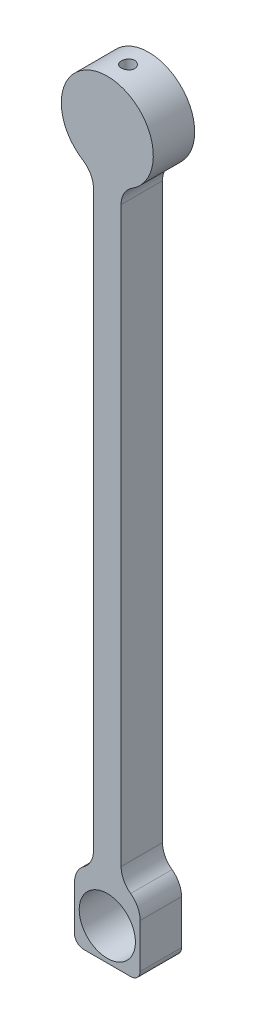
from build123d import *

# Parameters (mm, degrees)
SKETCH1_R               = 10
BOSS_EXTRUDE1_DEPTH     = 9
CUT_EXTRUDE1_DEPTH      = 10
SKETCH3_W               = 14.282856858
SKETCH3_H               = 9
BOSS_EXTRUDE2_DEPTH     = 150
SKETCH4_R               = 6.11
CUT_EXTRUDE2_DEPTH      = 10
FILLET1_R               = 5
FILLET2_R               = 2
CUT_EXTRUDE5_DEPTH      = 158.575378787
CUT_EXTRUDE5_DEPTH_BACK = 158.575378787
FILLET3_R               = 5
BOSS_EXTRUDE3_START     = -2
BOSS_EXTRUDE3_DEPTH     = 2
SKETCH10_R              = 1.45
CUT_EXTRUDE6_DEPTH      = 10


with BuildPart() as part:
    # Sketch1 → Boss-Extrude1 (new body)
    with BuildSketch(Plane.XY):
        Circle(SKETCH1_R)
        with BuildLine():
            Line((-1.862913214, 2.723885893), (1.862913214, 2.723885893))
            ThreePointArc((1.862913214, 2.723885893), (0, -3.3), (-1.862913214, 2.723885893))
        make_face(mode=Mode.SUBTRACT)
    extrude(amount=BOSS_EXTRUDE1_DEPTH)

    # Sketch2 → Cut-Extrude1 (cut)
    with BuildSketch(Plane(origin=(0, 0, 0), x_dir=(-1, 0, 0), z_dir=(0, 0, -1))):
        with BuildLine():
            Line((7.141428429, -7), (-7.141428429, -7))
            ThreePointArc((-7.141428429, -7), (-3.872983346, -9.219544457), (0, -10))
            ThreePointArc((0, -10), (3.872983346, -9.219544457), (7.141428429, -7))
        make_face()
    extrude(amount=-CUT_EXTRUDE1_DEPTH, mode=Mode.SUBTRACT)

    # Sketch3 → Boss-Extrude2 (add)
    with BuildSketch(Plane.XZ.offset(7)):
        with Locations((0, 4.5)):
            Rectangle(SKETCH3_W, SKETCH3_H)
    extrude(amount=BOSS_EXTRUDE2_DEPTH)

    # Sketch4 → Cut-Extrude2 (cut)
    with BuildSketch(Plane(origin=(0, 0, 0), x_dir=(-1, 0, 0), z_dir=(0, 0, -1))):
        with Locations((0, -150)):
            Circle(SKETCH4_R)
    extrude(amount=-CUT_EXTRUDE2_DEPTH, mode=Mode.SUBTRACT)

    # Fillet1
    fillet1_edges = [part.edges().sort_by_distance(p)[0] for p in [
        (7.141428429, -7, 4.5),
        (-7.141428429, -7, 4.5),
    ]]
    fillet(fillet1_edges, radius=FILLET1_R)

    # Fillet2
    fillet2_edges = [part.edges().sort_by_distance(p)[0] for p in [
        (-7.141428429, -157, 4.5),
        (7.141428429, -157, 4.5),
    ]]
    fillet(fillet2_edges, radius=FILLET2_R)

    # Sketch8 → Cut-Extrude5 (cut, two sides: drawn at the far end of the back side and taken through both)
    with BuildSketch(Plane(origin=(0, 0, 0), x_dir=(-1, 0, 0), z_dir=(0, 0, -1)).offset(-CUT_EXTRUDE5_DEPTH_BACK)):
        with BuildLine():
            Line((-3, -137.31142246), (-3, -12.68857754))
            ThreePointArc((-3, -12.68857754), (-3.622024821, -10.273348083), (-5.333333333, -8.459051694))
            ThreePointArc((-5.333333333, -8.459051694), (-6.837266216, -7.297382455), (-8.094285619, -5.872183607))
            ThreePointArc((-8.094285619, -5.872183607), (-7.385604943, -7.264856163), (-7.141428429, -8.808275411))
            Line((-7.141428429, -8.808275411), (-7.141428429, -143))
            ThreePointArc((-7.141428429, -143), (-6.279898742, -142.217784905), (-5.333333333, -141.540948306))
            ThreePointArc((-5.333333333, -141.540948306), (-3.622024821, -139.726651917), (-3, -137.31142246))
        make_face()
        with BuildLine():
            ThreePointArc((7.141428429, -8.808275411), (7.385604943, -7.264856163), (8.094285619, -5.872183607))
            ThreePointArc((8.094285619, -5.872183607), (6.837266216, -7.297382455), (5.333333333, -8.459051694))
            ThreePointArc((5.333333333, -8.459051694), (3.622024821, -10.273348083), (3, -12.68857754))
            Line((3, -12.68857754), (3, -137.31142246))
            ThreePointArc((3, -137.31142246), (3.622024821, -139.726651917), (5.333333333, -141.540948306))
            ThreePointArc((5.333333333, -141.540948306), (6.279898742, -142.217784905), (7.141428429, -143))
            Line((7.141428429, -143), (7.141428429, -8.808275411))
        make_face()
    extrude(amount=CUT_EXTRUDE5_DEPTH + CUT_EXTRUDE5_DEPTH_BACK, mode=Mode.SUBTRACT)

    # Fillet3
    fillet3_edges = [part.edges().sort_by_distance(p)[0] for p in [
        (-7.141428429, -143, 4.5),
        (7.141428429, -143, 4.5),
    ]]
    fillet(fillet3_edges, radius=FILLET3_R)

    # Sketch9 → Boss-Extrude3 (add)
    with BuildSketch(Plane.XY.offset(9).offset(BOSS_EXTRUDE3_START)):
        with BuildLine():
            Line((-1.862913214, 2.723885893), (1.862913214, 2.723885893))
            ThreePointArc((1.862913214, 2.723885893), (0, -3.3), (-1.862913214, 2.723885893))
        make_face()
    extrude(amount=BOSS_EXTRUDE3_DEPTH)

    # Sketch10 → Cut-Extrude6 (cut)
    with BuildSketch(Plane(origin=(0, 10, 0), x_dir=(1, 0, 0), z_dir=(0, 1, 0))):
        with Locations(Location((0, -4.5, 0), (0, 0, 270))):
            Circle(SKETCH10_R)
    extrude(amount=-CUT_EXTRUDE6_DEPTH, mode=Mode.SUBTRACT)


solid = part.part
